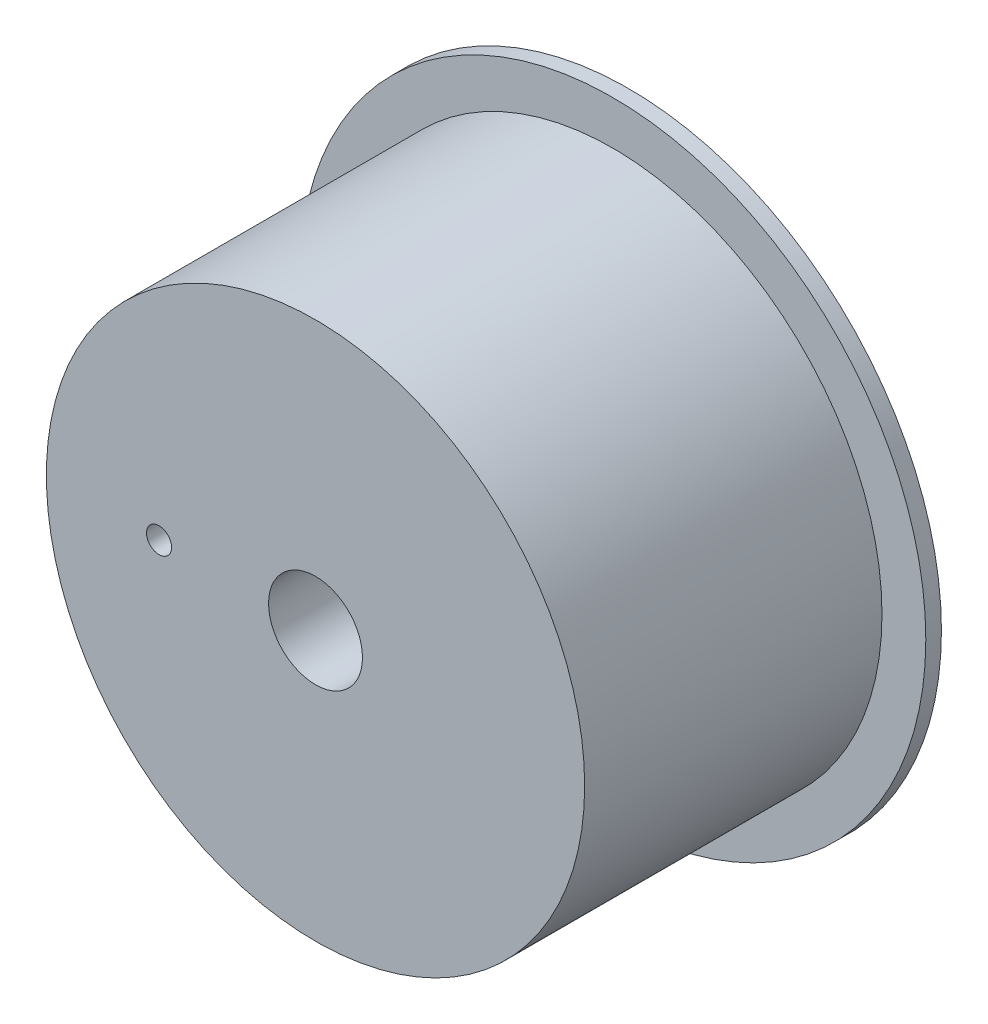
from build123d import *

# Parameters (mm, degrees)
ESQUISSE1_R                       = 10
BOSS_EXTRU_1_DEPTH                = 0.5
ESQUISSE2_R                       = 8.6
BOSS_EXTRU_2_DEPTH                = 9.5
ESQUISSE3_R                       = 8
ESQUISSE3_R_2                     = 3
ENL_V_MAT_EXTRU_1_DEPTH           = 6
DIAM_TRE_DU_PER_AGE_0_15_0_15_1_D = 3
DIAM_TRE_DU_PER_AGE_0_15_0_15_2_D = 0.8


with BuildPart() as part:
    # Esquisse1 → Boss.-Extru.1 (new body)
    with BuildSketch(Plane.XY):
        Circle(ESQUISSE1_R)
    extrude(amount=BOSS_EXTRU_1_DEPTH)

    # Esquisse2 → Boss.-Extru.2 (add)
    with BuildSketch(Plane.XY.offset(0.5)):
        Circle(ESQUISSE2_R)
    extrude(amount=BOSS_EXTRU_2_DEPTH)

    # Esquisse3 → Enl_v. mat.-Extru.1 (cut)
    with BuildSketch(Plane(origin=(0, 0, 0), x_dir=(-1, 0, 0), z_dir=(0, 0, -1))):
        Circle(ESQUISSE3_R)
        Circle(ESQUISSE3_R_2, mode=Mode.SUBTRACT)
    extrude(amount=-ENL_V_MAT_EXTRU_1_DEPTH, mode=Mode.SUBTRACT)

    # Diam_tre du per_age _0.15 _0.15_1 (through all)
    with Locations(Plane(origin=(0, 0, 0), x_dir=(-1, 0, 0), z_dir=(0, 0, -1))):
        with Locations((0, 0)):
            Hole(DIAM_TRE_DU_PER_AGE_0_15_0_15_1_D / 2)

    # Diam_tre du per_age _0.15 _0.15_2 (through all)
    with Locations(Plane(origin=(0, 0, 6), x_dir=(-1, 0, 0), z_dir=(0, 0, -1))):
        with Locations((5, 0)):
            Hole(DIAM_TRE_DU_PER_AGE_0_15_0_15_2_D / 2)


solid = part.part
